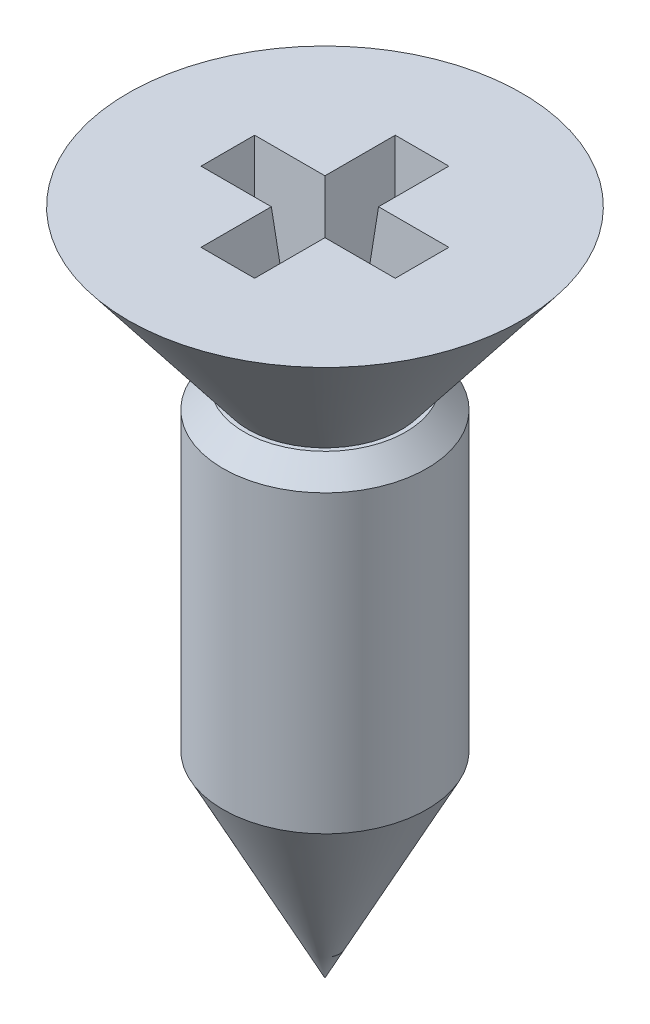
from build123d import *

# Parameters (mm, degrees)
CHANFREIN2_SIZE         = 0.3
ENL_V_MAT_EXTRU_1_DEPTH = 1.5
D_POUILLE1_ANGLE        = 5


with BuildPart() as part:
    # Esquisse1 → R_volution1 (revolve)
    with BuildSketch(Plane.XY, mode=Mode.PRIVATE) as r_volution1_sk:
        Polygon((0, -3.448239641), (2.8, -3.448239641), (1.09, -5.648239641), (1.45, -5.648239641), (1.45, -10.148239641), (0, -12.948239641), align=None)
    revolve(r_volution1_sk.sketch.rotate(Axis((0, 0, 0), (0, -1, 0)), 90), axis=Axis((0, 0, 0), (0, -1, 0)))

    # Chanfrein2
    chanfrein2_edges = [part.edges().sort_by_distance(p)[0] for p in [
        (0, -5.648239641, -1.45),
    ]]
    chamfer(chanfrein2_edges, length=CHANFREIN2_SIZE)

    # Esquisse2 → Enl_v. mat.-Extru.1 (cut)
    with BuildSketch(Plane(origin=(0, -3.448239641, 0), x_dir=(-1, 0, 0), z_dir=(0, 1, 0))):
        Polygon((0.25, -1.25), (-0.25, -1.25), (-0.25, -0.25), (-1.25, -0.25), (-1.25, 0.25), (-0.25, 0.25), (-0.25, 1.25), (0.25, 1.25), (0.25, 0.25), (1.25, 0.25), (1.25, -0.25), (0.25, -0.25), align=None)
    extrude(amount=-ENL_V_MAT_EXTRU_1_DEPTH, mode=Mode.SUBTRACT)

    # D_pouille1
    d_pouille1_faces = [part.faces().sort_by_distance(p)[0] for p in [
        (0.25, -4.198239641, 0.75),
        (1.25, -4.198239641, 0),
        (0.25, -4.198239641, -0.75),
        (-0.25, -4.198239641, 0.75),
        (-0.25, -4.198239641, -0.75),
        (-1.25, -4.198239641, 0),
        (0, -4.198239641, 1.25),
        (-0.75, -4.198239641, 0.25),
        (0.75, -4.198239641, 0.25),
        (0, -4.198239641, -1.25),
        (0.75, -4.198239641, -0.25),
        (-0.75, -4.198239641, -0.25),
    ]]
    draft(d_pouille1_faces, Plane(origin=(-0.25, -4.948239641, 0.25), x_dir=(0, 0, 1), z_dir=(0, 1, 0)), D_POUILLE1_ANGLE)


solid = part.part
